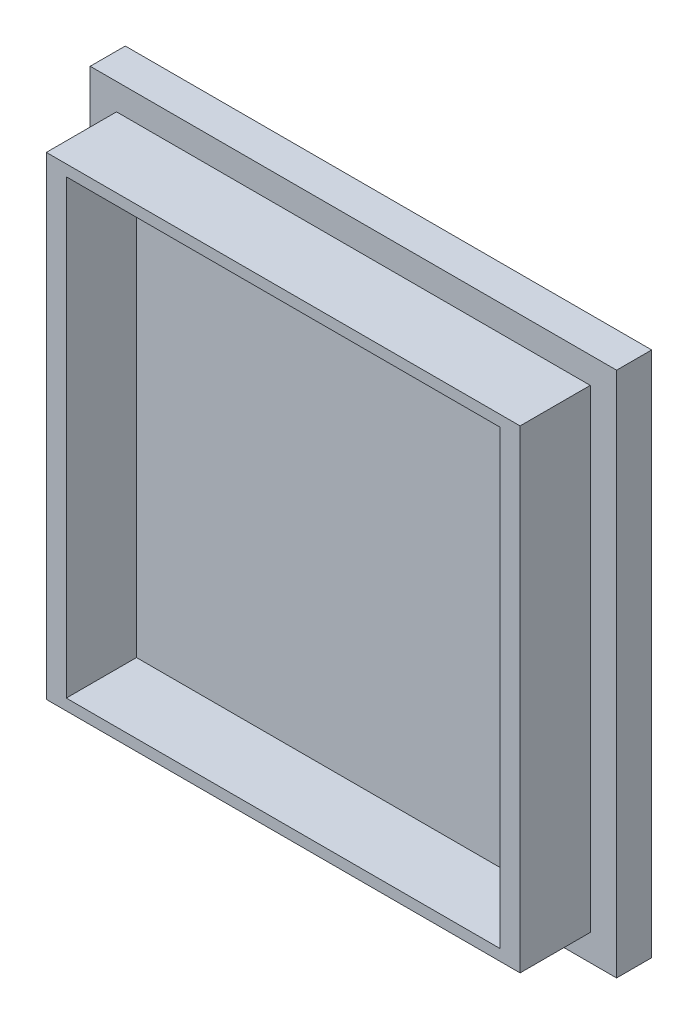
ISO-10303-21;
HEADER;
FILE_DESCRIPTION(('STEP AP214'),'2;1');
FILE_NAME('part.step','',(''),(''),'','','');
FILE_SCHEMA(('AUTOMOTIVE_DESIGN { 1 0 10303 214 1 1 1 1 }'));
ENDSEC;
DATA;
#1=APPLICATION_CONTEXT('core data for automotive mechanical design processes');
#2=APPLICATION_PROTOCOL_DEFINITION('international standard','automotive_design',2000,#1);
#3=PRODUCT_CONTEXT('',#1,'mechanical');
#4=PRODUCT('Part','Part','',(#3));
#5=PRODUCT_RELATED_PRODUCT_CATEGORY('part','',(#4));
#6=PRODUCT_DEFINITION_FORMATION('','',#4);
#7=PRODUCT_DEFINITION_CONTEXT('part definition',#1,'design');
#8=PRODUCT_DEFINITION('design','',#6,#7);
#9=PRODUCT_DEFINITION_SHAPE('','',#8);
#10=(LENGTH_UNIT() NAMED_UNIT(*) SI_UNIT(.MILLI.,.METRE.));
#11=(NAMED_UNIT(*) PLANE_ANGLE_UNIT() SI_UNIT($,.RADIAN.));
#12=(NAMED_UNIT(*) SI_UNIT($,.STERADIAN.) SOLID_ANGLE_UNIT());
#13=UNCERTAINTY_MEASURE_WITH_UNIT(LENGTH_MEASURE(1.E-05),#10,'distance_accuracy_value','');
#14=(GEOMETRIC_REPRESENTATION_CONTEXT(3) GLOBAL_UNCERTAINTY_ASSIGNED_CONTEXT((#13)) GLOBAL_UNIT_ASSIGNED_CONTEXT((#10,
#11,#12)) REPRESENTATION_CONTEXT('',''));
#15=CARTESIAN_POINT('',(0.,0.,0.));
#16=DIRECTION('',(0.,0.,1.));
#17=DIRECTION('',(1.,0.,0.));
#18=AXIS2_PLACEMENT_3D('',#15,#16,#17);
#19=CARTESIAN_POINT('',(0.,0.,2.54));
#20=DIRECTION('',(0.,0.,1.));
#21=DIRECTION('',(1.,0.,0.));
#22=AXIS2_PLACEMENT_3D('',#19,#20,#21);
#23=PLANE('',#22);
#24=DIRECTION('',(0.,1.,0.));
#25=VECTOR('',#24,1.);
#26=CARTESIAN_POINT('',(19.05,19.05,2.54));
#27=LINE('',#26,#25);
#28=CARTESIAN_POINT('',(19.05,-19.05,2.54));
#29=VERTEX_POINT('',#28);
#30=CARTESIAN_POINT('',(19.05,19.05,2.54));
#31=VERTEX_POINT('',#30);
#32=EDGE_CURVE('E225',#29,#31,#27,.T.);
#33=ORIENTED_EDGE('',*,*,#32,.T.);
#34=DIRECTION('',(-1.,0.,0.));
#35=VECTOR('',#34,1.);
#36=CARTESIAN_POINT('',(-19.05,19.05,2.54));
#37=LINE('',#36,#35);
#38=CARTESIAN_POINT('',(-19.05,19.05,2.54));
#39=VERTEX_POINT('',#38);
#40=EDGE_CURVE('E229',#31,#39,#37,.T.);
#41=ORIENTED_EDGE('',*,*,#40,.T.);
#42=DIRECTION('',(0.,-1.,0.));
#43=VECTOR('',#42,1.);
#44=CARTESIAN_POINT('',(-19.05,19.05,2.54));
#45=LINE('',#44,#43);
#46=CARTESIAN_POINT('',(-19.05,-19.05,2.54));
#47=VERTEX_POINT('',#46);
#48=EDGE_CURVE('E233',#39,#47,#45,.T.);
#49=ORIENTED_EDGE('',*,*,#48,.T.);
#50=DIRECTION('',(1.,0.,0.));
#51=VECTOR('',#50,1.);
#52=CARTESIAN_POINT('',(-19.05,-19.05,2.54));
#53=LINE('',#52,#51);
#54=EDGE_CURVE('E236',#47,#29,#53,.T.);
#55=ORIENTED_EDGE('',*,*,#54,.T.);
#56=EDGE_LOOP('',(#33,#41,#49,#55));
#57=FACE_BOUND('',#56,.T.);
#58=DIRECTION('',(-1.,0.,0.));
#59=VECTOR('',#58,1.);
#60=CARTESIAN_POINT('',(-17.145,17.145,2.54));
#61=LINE('',#60,#59);
#62=CARTESIAN_POINT('',(17.145,17.145,2.54));
#63=VERTEX_POINT('',#62);
#64=CARTESIAN_POINT('',(-17.145,17.145,2.54));
#65=VERTEX_POINT('',#64);
#66=EDGE_CURVE('E204',#63,#65,#61,.T.);
#67=ORIENTED_EDGE('',*,*,#66,.F.);
#68=DIRECTION('',(0.,1.,0.));
#69=VECTOR('',#68,1.);
#70=CARTESIAN_POINT('',(17.145,17.145,2.54));
#71=LINE('',#70,#69);
#72=CARTESIAN_POINT('',(17.145,-17.145,2.54));
#73=VERTEX_POINT('',#72);
#74=EDGE_CURVE('E154',#73,#63,#71,.T.);
#75=ORIENTED_EDGE('',*,*,#74,.F.);
#76=DIRECTION('',(1.,0.,0.));
#77=VECTOR('',#76,1.);
#78=CARTESIAN_POINT('',(-17.145,-17.145,2.54));
#79=LINE('',#78,#77);
#80=CARTESIAN_POINT('',(-17.145,-17.145,2.54));
#81=VERTEX_POINT('',#80);
#82=EDGE_CURVE('E191',#81,#73,#79,.T.);
#83=ORIENTED_EDGE('',*,*,#82,.F.);
#84=DIRECTION('',(0.,-1.,0.));
#85=VECTOR('',#84,1.);
#86=CARTESIAN_POINT('',(-17.145,17.145,2.54));
#87=LINE('',#86,#85);
#88=EDGE_CURVE('E207',#65,#81,#87,.T.);
#89=ORIENTED_EDGE('',*,*,#88,.F.);
#90=EDGE_LOOP('',(#67,#75,#83,#89));
#91=FACE_BOUND('',#90,.T.);
#92=ADVANCED_FACE('F43',(#57,#91),#23,.T.);
#93=CARTESIAN_POINT('',(19.05,19.05,2.54));
#94=DIRECTION('',(-1.,0.,0.));
#95=DIRECTION('',(0.,-1.,0.));
#96=AXIS2_PLACEMENT_3D('',#93,#94,#95);
#97=PLANE('',#96);
#98=DIRECTION('',(0.,1.,0.));
#99=VECTOR('',#98,1.);
#100=CARTESIAN_POINT('',(19.05,19.05,0.));
#101=LINE('',#100,#99);
#102=CARTESIAN_POINT('',(19.05,-19.05,0.));
#103=VERTEX_POINT('',#102);
#104=CARTESIAN_POINT('',(19.05,19.05,0.));
#105=VERTEX_POINT('',#104);
#106=EDGE_CURVE('E224',#103,#105,#101,.T.);
#107=ORIENTED_EDGE('',*,*,#106,.T.);
#108=DIRECTION('',(0.,0.,-1.));
#109=VECTOR('',#108,1.);
#110=CARTESIAN_POINT('',(19.05,19.05,2.54));
#111=LINE('',#110,#109);
#112=EDGE_CURVE('E11',#31,#105,#111,.T.);
#113=ORIENTED_EDGE('',*,*,#112,.F.);
#114=ORIENTED_EDGE('',*,*,#32,.F.);
#115=DIRECTION('',(0.,0.,-1.));
#116=VECTOR('',#115,1.);
#117=CARTESIAN_POINT('',(19.05,-19.05,2.54));
#118=LINE('',#117,#116);
#119=EDGE_CURVE('E239',#29,#103,#118,.T.);
#120=ORIENTED_EDGE('',*,*,#119,.T.);
#121=EDGE_LOOP('',(#107,#113,#114,#120));
#122=FACE_BOUND('',#121,.T.);
#123=ADVANCED_FACE('F45',(#122),#97,.F.);
#124=CARTESIAN_POINT('',(-19.05,19.05,2.54));
#125=DIRECTION('',(0.,-1.,0.));
#126=DIRECTION('',(0.,0.,-1.));
#127=AXIS2_PLACEMENT_3D('',#124,#125,#126);
#128=PLANE('',#127);
#129=DIRECTION('',(-1.,0.,0.));
#130=VECTOR('',#129,1.);
#131=CARTESIAN_POINT('',(-19.05,19.05,0.));
#132=LINE('',#131,#130);
#133=CARTESIAN_POINT('',(-19.05,19.05,0.));
#134=VERTEX_POINT('',#133);
#135=EDGE_CURVE('E243',#105,#134,#132,.T.);
#136=ORIENTED_EDGE('',*,*,#135,.T.);
#137=DIRECTION('',(0.,0.,-1.));
#138=VECTOR('',#137,1.);
#139=CARTESIAN_POINT('',(-19.05,19.05,2.54));
#140=LINE('',#139,#138);
#141=EDGE_CURVE('E52',#39,#134,#140,.T.);
#142=ORIENTED_EDGE('',*,*,#141,.F.);
#143=ORIENTED_EDGE('',*,*,#40,.F.);
#144=ORIENTED_EDGE('',*,*,#112,.T.);
#145=EDGE_LOOP('',(#136,#142,#143,#144));
#146=FACE_BOUND('',#145,.T.);
#147=ADVANCED_FACE('F279',(#146),#128,.F.);
#148=CARTESIAN_POINT('',(-19.05,19.05,2.54));
#149=DIRECTION('',(1.,0.,0.));
#150=DIRECTION('',(0.,1.,0.));
#151=AXIS2_PLACEMENT_3D('',#148,#149,#150);
#152=PLANE('',#151);
#153=DIRECTION('',(0.,-1.,0.));
#154=VECTOR('',#153,1.);
#155=CARTESIAN_POINT('',(-19.05,19.05,0.));
#156=LINE('',#155,#154);
#157=CARTESIAN_POINT('',(-19.05,-19.05,0.));
#158=VERTEX_POINT('',#157);
#159=EDGE_CURVE('E246',#134,#158,#156,.T.);
#160=ORIENTED_EDGE('',*,*,#159,.T.);
#161=DIRECTION('',(0.,0.,-1.));
#162=VECTOR('',#161,1.);
#163=CARTESIAN_POINT('',(-19.05,-19.05,2.54));
#164=LINE('',#163,#162);
#165=EDGE_CURVE('E254',#47,#158,#164,.T.);
#166=ORIENTED_EDGE('',*,*,#165,.F.);
#167=ORIENTED_EDGE('',*,*,#48,.F.);
#168=ORIENTED_EDGE('',*,*,#141,.T.);
#169=EDGE_LOOP('',(#160,#166,#167,#168));
#170=FACE_BOUND('',#169,.T.);
#171=ADVANCED_FACE('F263',(#170),#152,.F.);
#172=CARTESIAN_POINT('',(-19.05,-19.05,2.54));
#173=DIRECTION('',(0.,1.,0.));
#174=DIRECTION('',(0.,0.,1.));
#175=AXIS2_PLACEMENT_3D('',#172,#173,#174);
#176=PLANE('',#175);
#177=DIRECTION('',(1.,0.,0.));
#178=VECTOR('',#177,1.);
#179=CARTESIAN_POINT('',(-19.05,-19.05,0.));
#180=LINE('',#179,#178);
#181=EDGE_CURVE('E230',#158,#103,#180,.T.);
#182=ORIENTED_EDGE('',*,*,#181,.T.);
#183=ORIENTED_EDGE('',*,*,#119,.F.);
#184=ORIENTED_EDGE('',*,*,#54,.F.);
#185=ORIENTED_EDGE('',*,*,#165,.T.);
#186=EDGE_LOOP('',(#182,#183,#184,#185));
#187=FACE_BOUND('',#186,.T.);
#188=ADVANCED_FACE('F272',(#187),#176,.F.);
#189=CARTESIAN_POINT('',(0.,0.,0.));
#190=DIRECTION('',(0.,0.,1.));
#191=DIRECTION('',(1.,0.,0.));
#192=AXIS2_PLACEMENT_3D('',#189,#190,#191);
#193=PLANE('',#192);
#194=ORIENTED_EDGE('',*,*,#106,.F.);
#195=ORIENTED_EDGE('',*,*,#181,.F.);
#196=ORIENTED_EDGE('',*,*,#159,.F.);
#197=ORIENTED_EDGE('',*,*,#135,.F.);
#198=EDGE_LOOP('',(#194,#195,#196,#197));
#199=FACE_BOUND('',#198,.T.);
#200=ADVANCED_FACE('F269',(#199),#193,.F.);
#201=CARTESIAN_POINT('',(0.,0.,7.62));
#202=DIRECTION('',(0.,0.,1.));
#203=DIRECTION('',(1.,0.,0.));
#204=AXIS2_PLACEMENT_3D('',#201,#202,#203);
#205=PLANE('',#204);
#206=DIRECTION('',(0.,1.,0.));
#207=VECTOR('',#206,1.);
#208=CARTESIAN_POINT('',(17.145,17.145,7.62));
#209=LINE('',#208,#207);
#210=CARTESIAN_POINT('',(17.145,-17.145,7.62));
#211=VERTEX_POINT('',#210);
#212=CARTESIAN_POINT('',(17.145,17.145,7.62));
#213=VERTEX_POINT('',#212);
#214=EDGE_CURVE('E186',#211,#213,#209,.T.);
#215=ORIENTED_EDGE('',*,*,#214,.T.);
#216=DIRECTION('',(-1.,0.,0.));
#217=VECTOR('',#216,1.);
#218=CARTESIAN_POINT('',(-17.145,17.145,7.62));
#219=LINE('',#218,#217);
#220=CARTESIAN_POINT('',(-17.145,17.145,7.62));
#221=VERTEX_POINT('',#220);
#222=EDGE_CURVE('E190',#213,#221,#219,.T.);
#223=ORIENTED_EDGE('',*,*,#222,.T.);
#224=DIRECTION('',(0.,-1.,0.));
#225=VECTOR('',#224,1.);
#226=CARTESIAN_POINT('',(-17.145,17.145,7.62));
#227=LINE('',#226,#225);
#228=CARTESIAN_POINT('',(-17.145,-17.145,7.62));
#229=VERTEX_POINT('',#228);
#230=EDGE_CURVE('E194',#221,#229,#227,.T.);
#231=ORIENTED_EDGE('',*,*,#230,.T.);
#232=DIRECTION('',(1.,0.,0.));
#233=VECTOR('',#232,1.);
#234=CARTESIAN_POINT('',(-17.145,-17.145,7.62));
#235=LINE('',#234,#233);
#236=EDGE_CURVE('E197',#229,#211,#235,.T.);
#237=ORIENTED_EDGE('',*,*,#236,.T.);
#238=EDGE_LOOP('',(#215,#223,#231,#237));
#239=FACE_BOUND('',#238,.T.);
#240=DIRECTION('',(-1.,0.,0.));
#241=VECTOR('',#240,1.);
#242=CARTESIAN_POINT('',(-15.699376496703,16.3395268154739,7.62));
#243=LINE('',#242,#241);
#244=CARTESIAN_POINT('',(15.699376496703,16.3395268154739,7.62));
#245=VERTEX_POINT('',#244);
#246=CARTESIAN_POINT('',(-15.699376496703,16.3395268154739,7.62));
#247=VERTEX_POINT('',#246);
#248=EDGE_CURVE('E145',#245,#247,#243,.T.);
#249=ORIENTED_EDGE('',*,*,#248,.F.);
#250=DIRECTION('',(0.,1.,0.));
#251=VECTOR('',#250,1.);
#252=CARTESIAN_POINT('',(15.699376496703,16.3395268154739,7.62));
#253=LINE('',#252,#251);
#254=CARTESIAN_POINT('',(15.699376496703,-16.3395268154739,7.62));
#255=VERTEX_POINT('',#254);
#256=EDGE_CURVE('E135',#255,#245,#253,.T.);
#257=ORIENTED_EDGE('',*,*,#256,.F.);
#258=DIRECTION('',(1.,0.,0.));
#259=VECTOR('',#258,1.);
#260=CARTESIAN_POINT('',(-15.699376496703,-16.3395268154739,7.62));
#261=LINE('',#260,#259);
#262=CARTESIAN_POINT('',(-15.699376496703,-16.3395268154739,7.62));
#263=VERTEX_POINT('',#262);
#264=EDGE_CURVE('E164',#263,#255,#261,.T.);
#265=ORIENTED_EDGE('',*,*,#264,.F.);
#266=DIRECTION('',(0.,-1.,0.));
#267=VECTOR('',#266,1.);
#268=CARTESIAN_POINT('',(-15.699376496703,16.3395268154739,7.62));
#269=LINE('',#268,#267);
#270=EDGE_CURVE('E160',#247,#263,#269,.T.);
#271=ORIENTED_EDGE('',*,*,#270,.F.);
#272=EDGE_LOOP('',(#249,#257,#265,#271));
#273=FACE_BOUND('',#272,.T.);
#274=ADVANCED_FACE('F158',(#239,#273),#205,.T.);
#275=CARTESIAN_POINT('',(17.145,17.145,7.62));
#276=DIRECTION('',(-1.,0.,0.));
#277=DIRECTION('',(0.,-1.,0.));
#278=AXIS2_PLACEMENT_3D('',#275,#276,#277);
#279=PLANE('',#278);
#280=ORIENTED_EDGE('',*,*,#74,.T.);
#281=DIRECTION('',(0.,0.,-1.));
#282=VECTOR('',#281,1.);
#283=CARTESIAN_POINT('',(17.145,17.145,7.62));
#284=LINE('',#283,#282);
#285=EDGE_CURVE('E221',#213,#63,#284,.T.);
#286=ORIENTED_EDGE('',*,*,#285,.F.);
#287=ORIENTED_EDGE('',*,*,#214,.F.);
#288=DIRECTION('',(0.,0.,-1.));
#289=VECTOR('',#288,1.);
#290=CARTESIAN_POINT('',(17.145,-17.145,7.62));
#291=LINE('',#290,#289);
#292=EDGE_CURVE('E200',#211,#73,#291,.T.);
#293=ORIENTED_EDGE('',*,*,#292,.T.);
#294=EDGE_LOOP('',(#280,#286,#287,#293));
#295=FACE_BOUND('',#294,.T.);
#296=ADVANCED_FACE('F315',(#295),#279,.F.);
#297=CARTESIAN_POINT('',(-17.145,17.145,7.62));
#298=DIRECTION('',(0.,-1.,0.));
#299=DIRECTION('',(0.,0.,-1.));
#300=AXIS2_PLACEMENT_3D('',#297,#298,#299);
#301=PLANE('',#300);
#302=ORIENTED_EDGE('',*,*,#66,.T.);
#303=DIRECTION('',(0.,0.,-1.));
#304=VECTOR('',#303,1.);
#305=CARTESIAN_POINT('',(-17.145,17.145,7.62));
#306=LINE('',#305,#304);
#307=EDGE_CURVE('E217',#221,#65,#306,.T.);
#308=ORIENTED_EDGE('',*,*,#307,.F.);
#309=ORIENTED_EDGE('',*,*,#222,.F.);
#310=ORIENTED_EDGE('',*,*,#285,.T.);
#311=EDGE_LOOP('',(#302,#308,#309,#310));
#312=FACE_BOUND('',#311,.T.);
#313=ADVANCED_FACE('F322',(#312),#301,.F.);
#314=CARTESIAN_POINT('',(-17.145,17.145,7.62));
#315=DIRECTION('',(1.,0.,0.));
#316=DIRECTION('',(0.,1.,0.));
#317=AXIS2_PLACEMENT_3D('',#314,#315,#316);
#318=PLANE('',#317);
#319=ORIENTED_EDGE('',*,*,#88,.T.);
#320=DIRECTION('',(0.,0.,-1.));
#321=VECTOR('',#320,1.);
#322=CARTESIAN_POINT('',(-17.145,-17.145,7.62));
#323=LINE('',#322,#321);
#324=EDGE_CURVE('E59',#229,#81,#323,.T.);
#325=ORIENTED_EDGE('',*,*,#324,.F.);
#326=ORIENTED_EDGE('',*,*,#230,.F.);
#327=ORIENTED_EDGE('',*,*,#307,.T.);
#328=EDGE_LOOP('',(#319,#325,#326,#327));
#329=FACE_BOUND('',#328,.T.);
#330=ADVANCED_FACE('F319',(#329),#318,.F.);
#331=CARTESIAN_POINT('',(-17.145,-17.145,7.62));
#332=DIRECTION('',(0.,1.,0.));
#333=DIRECTION('',(0.,0.,1.));
#334=AXIS2_PLACEMENT_3D('',#331,#332,#333);
#335=PLANE('',#334);
#336=ORIENTED_EDGE('',*,*,#82,.T.);
#337=ORIENTED_EDGE('',*,*,#292,.F.);
#338=ORIENTED_EDGE('',*,*,#236,.F.);
#339=ORIENTED_EDGE('',*,*,#324,.T.);
#340=EDGE_LOOP('',(#336,#337,#338,#339));
#341=FACE_BOUND('',#340,.T.);
#342=ADVANCED_FACE('F312',(#341),#335,.F.);
#343=CARTESIAN_POINT('',(15.699376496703,16.3395268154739,7.62));
#344=DIRECTION('',(-1.,0.,0.));
#345=DIRECTION('',(0.,0.,1.));
#346=AXIS2_PLACEMENT_3D('',#343,#344,#345);
#347=PLANE('',#346);
#348=DIRECTION('',(0.,1.,0.));
#349=VECTOR('',#348,1.);
#350=CARTESIAN_POINT('',(15.699376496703,16.3395268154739,2.54));
#351=LINE('',#350,#349);
#352=CARTESIAN_POINT('',(15.699376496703,-16.3395268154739,2.54));
#353=VERTEX_POINT('',#352);
#354=CARTESIAN_POINT('',(15.699376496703,16.3395268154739,2.54));
#355=VERTEX_POINT('',#354);
#356=EDGE_CURVE('E67',#353,#355,#351,.T.);
#357=ORIENTED_EDGE('',*,*,#356,.F.);
#358=DIRECTION('',(0.,0.,-1.));
#359=VECTOR('',#358,1.);
#360=CARTESIAN_POINT('',(15.699376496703,-16.3395268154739,7.62));
#361=LINE('',#360,#359);
#362=EDGE_CURVE('E140',#255,#353,#361,.T.);
#363=ORIENTED_EDGE('',*,*,#362,.F.);
#364=ORIENTED_EDGE('',*,*,#256,.T.);
#365=DIRECTION('',(0.,0.,-1.));
#366=VECTOR('',#365,1.);
#367=CARTESIAN_POINT('',(15.699376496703,16.3395268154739,7.62));
#368=LINE('',#367,#366);
#369=EDGE_CURVE('E138',#245,#355,#368,.T.);
#370=ORIENTED_EDGE('',*,*,#369,.T.);
#371=EDGE_LOOP('',(#357,#363,#364,#370));
#372=FACE_BOUND('',#371,.T.);
#373=ADVANCED_FACE('F137',(#372),#347,.T.);
#374=CARTESIAN_POINT('',(-15.699376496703,16.3395268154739,7.62));
#375=DIRECTION('',(0.,-1.,0.));
#376=DIRECTION('',(0.,0.,-1.));
#377=AXIS2_PLACEMENT_3D('',#374,#375,#376);
#378=PLANE('',#377);
#379=DIRECTION('',(-1.,0.,0.));
#380=VECTOR('',#379,1.);
#381=CARTESIAN_POINT('',(-15.699376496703,16.3395268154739,2.54));
#382=LINE('',#381,#380);
#383=CARTESIAN_POINT('',(-15.699376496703,16.3395268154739,2.54));
#384=VERTEX_POINT('',#383);
#385=EDGE_CURVE('E152',#355,#384,#382,.T.);
#386=ORIENTED_EDGE('',*,*,#385,.F.);
#387=ORIENTED_EDGE('',*,*,#369,.F.);
#388=ORIENTED_EDGE('',*,*,#248,.T.);
#389=DIRECTION('',(0.,0.,-1.));
#390=VECTOR('',#389,1.);
#391=CARTESIAN_POINT('',(-15.699376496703,16.3395268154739,7.62));
#392=LINE('',#391,#390);
#393=EDGE_CURVE('E155',#247,#384,#392,.T.);
#394=ORIENTED_EDGE('',*,*,#393,.T.);
#395=EDGE_LOOP('',(#386,#387,#388,#394));
#396=FACE_BOUND('',#395,.T.);
#397=ADVANCED_FACE('F149',(#396),#378,.T.);
#398=CARTESIAN_POINT('',(-15.699376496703,16.3395268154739,7.62));
#399=DIRECTION('',(1.,0.,0.));
#400=DIRECTION('',(0.,0.,-1.));
#401=AXIS2_PLACEMENT_3D('',#398,#399,#400);
#402=PLANE('',#401);
#403=DIRECTION('',(0.,-1.,0.));
#404=VECTOR('',#403,1.);
#405=CARTESIAN_POINT('',(-15.699376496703,16.3395268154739,2.54));
#406=LINE('',#405,#404);
#407=CARTESIAN_POINT('',(-15.699376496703,-16.3395268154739,2.54));
#408=VERTEX_POINT('',#407);
#409=EDGE_CURVE('E173',#384,#408,#406,.T.);
#410=ORIENTED_EDGE('',*,*,#409,.F.);
#411=ORIENTED_EDGE('',*,*,#393,.F.);
#412=ORIENTED_EDGE('',*,*,#270,.T.);
#413=DIRECTION('',(0.,0.,-1.));
#414=VECTOR('',#413,1.);
#415=CARTESIAN_POINT('',(-15.699376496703,-16.3395268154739,7.62));
#416=LINE('',#415,#414);
#417=EDGE_CURVE('E180',#263,#408,#416,.T.);
#418=ORIENTED_EDGE('',*,*,#417,.T.);
#419=EDGE_LOOP('',(#410,#411,#412,#418));
#420=FACE_BOUND('',#419,.T.);
#421=ADVANCED_FACE('F298',(#420),#402,.T.);
#422=CARTESIAN_POINT('',(-15.699376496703,-16.3395268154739,7.62));
#423=DIRECTION('',(0.,1.,0.));
#424=DIRECTION('',(0.,0.,1.));
#425=AXIS2_PLACEMENT_3D('',#422,#423,#424);
#426=PLANE('',#425);
#427=DIRECTION('',(1.,0.,0.));
#428=VECTOR('',#427,1.);
#429=CARTESIAN_POINT('',(-15.699376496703,-16.3395268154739,2.54));
#430=LINE('',#429,#428);
#431=EDGE_CURVE('E146',#408,#353,#430,.T.);
#432=ORIENTED_EDGE('',*,*,#431,.F.);
#433=ORIENTED_EDGE('',*,*,#417,.F.);
#434=ORIENTED_EDGE('',*,*,#264,.T.);
#435=ORIENTED_EDGE('',*,*,#362,.T.);
#436=EDGE_LOOP('',(#432,#433,#434,#435));
#437=FACE_BOUND('',#436,.T.);
#438=ADVANCED_FACE('F294',(#437),#426,.T.);
#439=ORIENTED_EDGE('',*,*,#356,.T.);
#440=ORIENTED_EDGE('',*,*,#385,.T.);
#441=ORIENTED_EDGE('',*,*,#409,.T.);
#442=ORIENTED_EDGE('',*,*,#431,.T.);
#443=EDGE_LOOP('',(#439,#440,#441,#442));
#444=FACE_BOUND('',#443,.T.);
#445=ADVANCED_FACE('F288',(#444),#23,.T.);
#446=CLOSED_SHELL('',(#92,#123,#147,#171,#188,#200,#274,#296,#313,#330,#342,#373,#397,#421,#438,#445));
#447=MANIFOLD_SOLID_BREP('B2',#446);
#448=ADVANCED_BREP_SHAPE_REPRESENTATION('',(#18,#447),#14);
#449=SHAPE_DEFINITION_REPRESENTATION(#9,#448);
ENDSEC;
END-ISO-10303-21;
